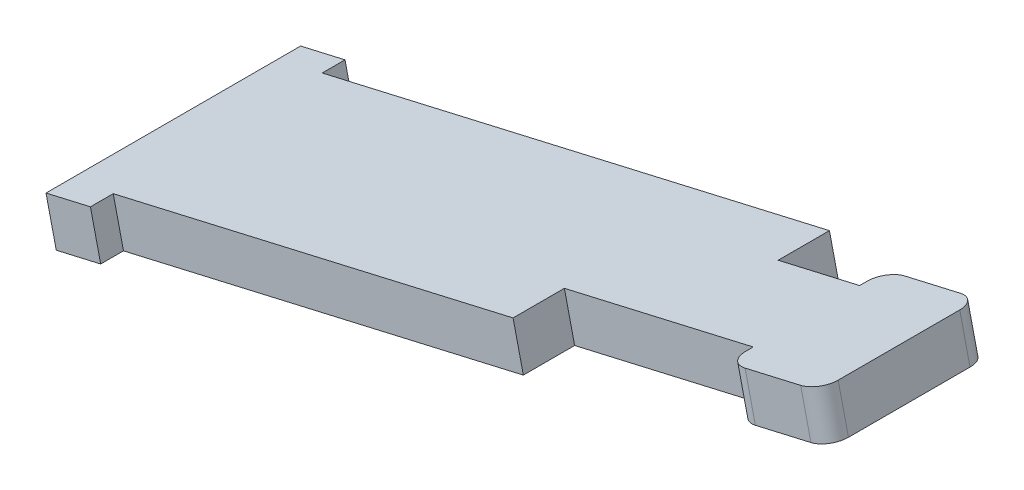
ISO-10303-21;
HEADER;
FILE_DESCRIPTION(('STEP AP214'),'2;1');
FILE_NAME('part.step','',(''),(''),'','','');
FILE_SCHEMA(('AUTOMOTIVE_DESIGN { 1 0 10303 214 1 1 1 1 }'));
ENDSEC;
DATA;
#1=APPLICATION_CONTEXT('core data for automotive mechanical design processes');
#2=APPLICATION_PROTOCOL_DEFINITION('international standard','automotive_design',2000,#1);
#3=PRODUCT_CONTEXT('',#1,'mechanical');
#4=PRODUCT('Part','Part','',(#3));
#5=PRODUCT_RELATED_PRODUCT_CATEGORY('part','',(#4));
#6=PRODUCT_DEFINITION_FORMATION('','',#4);
#7=PRODUCT_DEFINITION_CONTEXT('part definition',#1,'design');
#8=PRODUCT_DEFINITION('design','',#6,#7);
#9=PRODUCT_DEFINITION_SHAPE('','',#8);
#10=(LENGTH_UNIT() NAMED_UNIT(*) SI_UNIT(.MILLI.,.METRE.));
#11=(NAMED_UNIT(*) PLANE_ANGLE_UNIT() SI_UNIT($,.RADIAN.));
#12=(NAMED_UNIT(*) SI_UNIT($,.STERADIAN.) SOLID_ANGLE_UNIT());
#13=UNCERTAINTY_MEASURE_WITH_UNIT(LENGTH_MEASURE(1.E-05),#10,'distance_accuracy_value','');
#14=(GEOMETRIC_REPRESENTATION_CONTEXT(3) GLOBAL_UNCERTAINTY_ASSIGNED_CONTEXT((#13)) GLOBAL_UNIT_ASSIGNED_CONTEXT((#10,
#11,#12)) REPRESENTATION_CONTEXT('',''));
#15=CARTESIAN_POINT('',(0.,0.,0.));
#16=DIRECTION('',(0.,0.,1.));
#17=DIRECTION('',(1.,0.,0.));
#18=AXIS2_PLACEMENT_3D('',#15,#16,#17);
#19=CARTESIAN_POINT('',(-71.2352267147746,-19.5329859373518,27.5));
#20=DIRECTION('',(0.974370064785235,0.224951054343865,0.));
#21=DIRECTION('',(0.,0.,-1.));
#22=AXIS2_PLACEMENT_3D('',#19,#20,#21);
#23=PLANE('',#22);
#24=DIRECTION('',(0.,0.,1.));
#25=VECTOR('',#24,1.);
#26=CARTESIAN_POINT('',(-68.5358140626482,-31.2254267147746,27.5));
#27=LINE('',#26,#25);
#28=CARTESIAN_POINT('',(-68.5358140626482,-31.2254267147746,-33.5));
#29=VERTEX_POINT('',#28);
#30=CARTESIAN_POINT('',(-68.5358140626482,-31.2254267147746,33.5));
#31=VERTEX_POINT('',#30);
#32=EDGE_CURVE('E198',#29,#31,#27,.T.);
#33=ORIENTED_EDGE('',*,*,#32,.T.);
#34=DIRECTION('',(0.224951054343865,-0.974370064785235,0.));
#35=VECTOR('',#34,1.);
#36=CARTESIAN_POINT('',(-71.2352267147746,-19.5329859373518,33.5));
#37=LINE('',#36,#35);
#38=CARTESIAN_POINT('',(-71.2352267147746,-19.5329859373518,33.5));
#39=VERTEX_POINT('',#38);
#40=EDGE_CURVE('E197',#39,#31,#37,.T.);
#41=ORIENTED_EDGE('',*,*,#40,.F.);
#42=DIRECTION('',(0.,0.,1.));
#43=VECTOR('',#42,1.);
#44=CARTESIAN_POINT('',(-71.2352267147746,-19.5329859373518,-27.5));
#45=LINE('',#44,#43);
#46=CARTESIAN_POINT('',(-71.2352267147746,-19.5329859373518,-33.5));
#47=VERTEX_POINT('',#46);
#48=EDGE_CURVE('E182',#47,#39,#45,.T.);
#49=ORIENTED_EDGE('',*,*,#48,.F.);
#50=DIRECTION('',(0.224951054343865,-0.974370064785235,0.));
#51=VECTOR('',#50,1.);
#52=CARTESIAN_POINT('',(-71.2352267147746,-19.5329859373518,-33.5));
#53=LINE('',#52,#51);
#54=EDGE_CURVE('E239',#47,#29,#53,.T.);
#55=ORIENTED_EDGE('',*,*,#54,.T.);
#56=EDGE_LOOP('',(#33,#41,#49,#55));
#57=FACE_BOUND('',#56,.T.);
#58=ADVANCED_FACE('F45',(#57),#23,.F.);
#59=CARTESIAN_POINT('',(-71.2352267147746,-19.5329859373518,33.5));
#60=DIRECTION('',(0.,0.,-1.));
#61=DIRECTION('',(-0.974370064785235,-0.224951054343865,0.));
#62=AXIS2_PLACEMENT_3D('',#59,#60,#61);
#63=PLANE('',#62);
#64=DIRECTION('',(0.974370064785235,0.224951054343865,0.));
#65=VECTOR('',#64,1.);
#66=CARTESIAN_POINT('',(-68.5358140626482,-31.2254267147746,33.5));
#67=LINE('',#66,#65);
#68=CARTESIAN_POINT('',(-56.8433732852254,-28.5260140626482,33.5));
#69=VERTEX_POINT('',#68);
#70=EDGE_CURVE('E241',#31,#69,#67,.T.);
#71=ORIENTED_EDGE('',*,*,#70,.T.);
#72=DIRECTION('',(0.224951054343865,-0.974370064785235,0.));
#73=VECTOR('',#72,1.);
#74=CARTESIAN_POINT('',(-59.5427859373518,-16.8335732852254,33.5));
#75=LINE('',#74,#73);
#76=CARTESIAN_POINT('',(-59.5427859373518,-16.8335732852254,33.5));
#77=VERTEX_POINT('',#76);
#78=EDGE_CURVE('E202',#77,#69,#75,.T.);
#79=ORIENTED_EDGE('',*,*,#78,.F.);
#80=DIRECTION('',(0.974370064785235,0.224951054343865,0.));
#81=VECTOR('',#80,1.);
#82=CARTESIAN_POINT('',(-71.2352267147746,-19.5329859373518,33.5));
#83=LINE('',#82,#81);
#84=EDGE_CURVE('E187',#39,#77,#83,.T.);
#85=ORIENTED_EDGE('',*,*,#84,.F.);
#86=ORIENTED_EDGE('',*,*,#40,.T.);
#87=EDGE_LOOP('',(#71,#79,#85,#86));
#88=FACE_BOUND('',#87,.T.);
#89=ADVANCED_FACE('F204',(#88),#63,.F.);
#90=CARTESIAN_POINT('',(-59.5427859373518,-16.8335732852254,33.5));
#91=DIRECTION('',(-0.974370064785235,-0.224951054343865,0.));
#92=DIRECTION('',(0.,0.,1.));
#93=AXIS2_PLACEMENT_3D('',#90,#91,#92);
#94=PLANE('',#93);
#95=DIRECTION('',(0.,0.,-1.));
#96=VECTOR('',#95,1.);
#97=CARTESIAN_POINT('',(-56.8433732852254,-28.5260140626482,33.5));
#98=LINE('',#97,#96);
#99=CARTESIAN_POINT('',(-56.8433732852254,-28.5260140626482,27.5));
#100=VERTEX_POINT('',#99);
#101=EDGE_CURVE('E243',#69,#100,#98,.T.);
#102=ORIENTED_EDGE('',*,*,#101,.T.);
#103=DIRECTION('',(0.224951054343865,-0.974370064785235,0.));
#104=VECTOR('',#103,1.);
#105=CARTESIAN_POINT('',(-59.5427859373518,-16.8335732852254,27.5));
#106=LINE('',#105,#104);
#107=CARTESIAN_POINT('',(-59.5427859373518,-16.8335732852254,27.5));
#108=VERTEX_POINT('',#107);
#109=EDGE_CURVE('E300',#108,#100,#106,.T.);
#110=ORIENTED_EDGE('',*,*,#109,.F.);
#111=DIRECTION('',(0.,0.,-1.));
#112=VECTOR('',#111,1.);
#113=CARTESIAN_POINT('',(-59.5427859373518,-16.8335732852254,33.5));
#114=LINE('',#113,#112);
#115=EDGE_CURVE('E207',#77,#108,#114,.T.);
#116=ORIENTED_EDGE('',*,*,#115,.F.);
#117=ORIENTED_EDGE('',*,*,#78,.T.);
#118=EDGE_LOOP('',(#102,#110,#116,#117));
#119=FACE_BOUND('',#118,.T.);
#120=ADVANCED_FACE('F369',(#119),#94,.F.);
#121=CARTESIAN_POINT('',(-59.5427859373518,-16.8335732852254,27.5));
#122=DIRECTION('',(0.,0.,-1.));
#123=DIRECTION('',(-0.974370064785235,-0.224951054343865,0.));
#124=AXIS2_PLACEMENT_3D('',#121,#122,#123);
#125=PLANE('',#124);
#126=DIRECTION('',(0.974370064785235,0.224951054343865,0.));
#127=VECTOR('',#126,1.);
#128=CARTESIAN_POINT('',(-56.8433732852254,-28.5260140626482,27.5));
#129=LINE('',#128,#127);
#130=CARTESIAN_POINT('',(48.38859371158,-4.2313001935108,27.5));
#131=VERTEX_POINT('',#130);
#132=EDGE_CURVE('E245',#100,#131,#129,.T.);
#133=ORIENTED_EDGE('',*,*,#132,.T.);
#134=DIRECTION('',(0.224951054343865,-0.974370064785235,0.));
#135=VECTOR('',#134,1.);
#136=CARTESIAN_POINT('',(45.6891810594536,7.46114058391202,27.5));
#137=LINE('',#136,#135);
#138=CARTESIAN_POINT('',(45.6891810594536,7.46114058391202,27.5));
#139=VERTEX_POINT('',#138);
#140=EDGE_CURVE('E297',#139,#131,#137,.T.);
#141=ORIENTED_EDGE('',*,*,#140,.F.);
#142=DIRECTION('',(0.974370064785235,0.224951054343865,0.));
#143=VECTOR('',#142,1.);
#144=CARTESIAN_POINT('',(-59.5427859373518,-16.8335732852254,27.5));
#145=LINE('',#144,#143);
#146=EDGE_CURVE('E209',#108,#139,#145,.T.);
#147=ORIENTED_EDGE('',*,*,#146,.F.);
#148=ORIENTED_EDGE('',*,*,#109,.T.);
#149=EDGE_LOOP('',(#133,#141,#147,#148));
#150=FACE_BOUND('',#149,.T.);
#151=ADVANCED_FACE('F376',(#150),#125,.F.);
#152=CARTESIAN_POINT('',(45.6891810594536,7.46114058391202,14.));
#153=DIRECTION('',(-0.974370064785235,-0.224951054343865,0.));
#154=DIRECTION('',(0.,0.,1.));
#155=AXIS2_PLACEMENT_3D('',#152,#153,#154);
#156=PLANE('',#155);
#157=DIRECTION('',(0.,0.,-1.));
#158=VECTOR('',#157,1.);
#159=CARTESIAN_POINT('',(48.38859371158,-4.2313001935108,14.));
#160=LINE('',#159,#158);
#161=CARTESIAN_POINT('',(48.38859371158,-4.2313001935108,14.));
#162=VERTEX_POINT('',#161);
#163=EDGE_CURVE('E247',#131,#162,#160,.T.);
#164=ORIENTED_EDGE('',*,*,#163,.T.);
#165=DIRECTION('',(0.224951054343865,-0.974370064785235,0.));
#166=VECTOR('',#165,1.);
#167=CARTESIAN_POINT('',(45.6891810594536,7.46114058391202,14.));
#168=LINE('',#167,#166);
#169=CARTESIAN_POINT('',(45.6891810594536,7.46114058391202,14.));
#170=VERTEX_POINT('',#169);
#171=EDGE_CURVE('E294',#170,#162,#168,.T.);
#172=ORIENTED_EDGE('',*,*,#171,.F.);
#173=DIRECTION('',(0.,0.,-1.));
#174=VECTOR('',#173,1.);
#175=CARTESIAN_POINT('',(45.6891810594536,7.46114058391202,14.));
#176=LINE('',#175,#174);
#177=EDGE_CURVE('E214',#139,#170,#176,.T.);
#178=ORIENTED_EDGE('',*,*,#177,.F.);
#179=ORIENTED_EDGE('',*,*,#140,.T.);
#180=EDGE_LOOP('',(#164,#172,#178,#179));
#181=FACE_BOUND('',#180,.T.);
#182=ADVANCED_FACE('F379',(#181),#156,.F.);
#183=CARTESIAN_POINT('',(73.9459129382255,13.9847211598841,14.));
#184=DIRECTION('',(0.,0.,-1.));
#185=DIRECTION('',(-0.974370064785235,-0.224951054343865,0.));
#186=AXIS2_PLACEMENT_3D('',#183,#184,#185);
#187=PLANE('',#186);
#188=DIRECTION('',(0.974370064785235,0.224951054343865,0.));
#189=VECTOR('',#188,1.);
#190=CARTESIAN_POINT('',(76.6453255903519,2.29228038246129,14.));
#191=LINE('',#190,#189);
#192=CARTESIAN_POINT('',(98.081467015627,7.24120357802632,14.));
#193=VERTEX_POINT('',#192);
#194=EDGE_CURVE('E250',#162,#193,#191,.T.);
#195=ORIENTED_EDGE('',*,*,#194,.T.);
#196=DIRECTION('',(0.224951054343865,-0.974370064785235,0.));
#197=VECTOR('',#196,1.);
#198=CARTESIAN_POINT('',(95.3820543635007,18.9336443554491,14.));
#199=LINE('',#198,#197);
#200=CARTESIAN_POINT('',(95.3820543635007,18.9336443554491,14.));
#201=VERTEX_POINT('',#200);
#202=EDGE_CURVE('E291',#201,#193,#199,.T.);
#203=ORIENTED_EDGE('',*,*,#202,.F.);
#204=DIRECTION('',(0.974370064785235,0.224951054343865,0.));
#205=VECTOR('',#204,1.);
#206=CARTESIAN_POINT('',(73.9459129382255,13.9847211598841,14.));
#207=LINE('',#206,#205);
#208=EDGE_CURVE('E216',#170,#201,#207,.T.);
#209=ORIENTED_EDGE('',*,*,#208,.F.);
#210=ORIENTED_EDGE('',*,*,#171,.T.);
#211=EDGE_LOOP('',(#195,#203,#209,#210));
#212=FACE_BOUND('',#211,.T.);
#213=ADVANCED_FACE('F383',(#212),#187,.F.);
#214=CARTESIAN_POINT('',(95.3820543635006,18.9336443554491,21.));
#215=DIRECTION('',(0.974370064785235,0.224951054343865,0.));
#216=DIRECTION('',(0.,0.,-1.));
#217=AXIS2_PLACEMENT_3D('',#214,#215,#216);
#218=PLANE('',#217);
#219=DIRECTION('',(0.,0.,1.));
#220=VECTOR('',#219,1.);
#221=CARTESIAN_POINT('',(98.081467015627,7.24120357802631,21.));
#222=LINE('',#221,#220);
#223=CARTESIAN_POINT('',(98.081467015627,7.24120357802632,16.));
#224=VERTEX_POINT('',#223);
#225=EDGE_CURVE('E252',#193,#224,#222,.T.);
#226=ORIENTED_EDGE('',*,*,#225,.T.);
#227=DIRECTION('',(0.224951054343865,-0.974370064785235,0.));
#228=VECTOR('',#227,1.);
#229=CARTESIAN_POINT('',(95.3820543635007,18.9336443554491,16.));
#230=LINE('',#229,#228);
#231=CARTESIAN_POINT('',(95.3820543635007,18.9336443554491,16.));
#232=VERTEX_POINT('',#231);
#233=EDGE_CURVE('E12',#224,#232,#230,.F.);
#234=ORIENTED_EDGE('',*,*,#233,.T.);
#235=DIRECTION('',(0.,0.,1.));
#236=VECTOR('',#235,1.);
#237=CARTESIAN_POINT('',(95.3820543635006,18.9336443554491,21.));
#238=LINE('',#237,#236);
#239=EDGE_CURVE('E218',#201,#232,#238,.T.);
#240=ORIENTED_EDGE('',*,*,#239,.F.);
#241=ORIENTED_EDGE('',*,*,#202,.T.);
#242=EDGE_LOOP('',(#226,#234,#240,#241));
#243=FACE_BOUND('',#242,.T.);
#244=ADVANCED_FACE('F460',(#243),#218,.F.);
#245=CARTESIAN_POINT('',(119.741305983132,24.5574207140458,21.));
#246=DIRECTION('',(0.,0.,-1.));
#247=DIRECTION('',(-0.974370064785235,-0.224951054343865,0.));
#248=AXIS2_PLACEMENT_3D('',#245,#246,#247);
#249=PLANE('',#248);
#250=DIRECTION('',(0.974370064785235,0.224951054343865,0.));
#251=VECTOR('',#250,1.);
#252=CARTESIAN_POINT('',(122.440718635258,12.8649799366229,21.));
#253=LINE('',#252,#251);
#254=CARTESIAN_POINT('',(102.953317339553,8.36595884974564,21.));
#255=VERTEX_POINT('',#254);
#256=CARTESIAN_POINT('',(117.568868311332,11.7402246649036,21.));
#257=VERTEX_POINT('',#256);
#258=EDGE_CURVE('E255',#255,#257,#253,.T.);
#259=ORIENTED_EDGE('',*,*,#258,.T.);
#260=DIRECTION('',(0.224951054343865,-0.974370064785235,0.));
#261=VECTOR('',#260,1.);
#262=CARTESIAN_POINT('',(114.869455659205,23.4326654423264,21.));
#263=LINE('',#262,#261);
#264=CARTESIAN_POINT('',(114.869455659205,23.4326654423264,21.));
#265=VERTEX_POINT('',#264);
#266=EDGE_CURVE('E319',#257,#265,#263,.F.);
#267=ORIENTED_EDGE('',*,*,#266,.T.);
#268=DIRECTION('',(0.974370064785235,0.224951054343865,0.));
#269=VECTOR('',#268,1.);
#270=CARTESIAN_POINT('',(119.741305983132,24.5574207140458,21.));
#271=LINE('',#270,#269);
#272=CARTESIAN_POINT('',(100.253904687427,20.0583996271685,21.));
#273=VERTEX_POINT('',#272);
#274=EDGE_CURVE('E221',#273,#265,#271,.T.);
#275=ORIENTED_EDGE('',*,*,#274,.F.);
#276=DIRECTION('',(0.224951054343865,-0.974370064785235,0.));
#277=VECTOR('',#276,1.);
#278=CARTESIAN_POINT('',(100.253904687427,20.0583996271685,21.));
#279=LINE('',#278,#277);
#280=EDGE_CURVE('E316',#273,#255,#279,.T.);
#281=ORIENTED_EDGE('',*,*,#280,.T.);
#282=EDGE_LOOP('',(#259,#267,#275,#281));
#283=FACE_BOUND('',#282,.T.);
#284=ADVANCED_FACE('F393',(#283),#249,.F.);
#285=CARTESIAN_POINT('',(119.741305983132,24.5574207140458,-21.));
#286=DIRECTION('',(-0.974370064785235,-0.224951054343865,0.));
#287=DIRECTION('',(0.,0.,1.));
#288=AXIS2_PLACEMENT_3D('',#285,#286,#287);
#289=PLANE('',#288);
#290=DIRECTION('',(0.,0.,-1.));
#291=VECTOR('',#290,1.);
#292=CARTESIAN_POINT('',(119.741305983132,24.5574207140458,-21.));
#293=LINE('',#292,#291);
#294=CARTESIAN_POINT('',(119.741305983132,24.5574207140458,16.));
#295=VERTEX_POINT('',#294);
#296=CARTESIAN_POINT('',(119.741305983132,24.5574207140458,-16.));
#297=VERTEX_POINT('',#296);
#298=EDGE_CURVE('E223',#295,#297,#293,.T.);
#299=ORIENTED_EDGE('',*,*,#298,.F.);
#300=DIRECTION('',(0.224951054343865,-0.974370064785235,0.));
#301=VECTOR('',#300,1.);
#302=CARTESIAN_POINT('',(119.741305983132,24.5574207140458,16.));
#303=LINE('',#302,#301);
#304=CARTESIAN_POINT('',(122.440718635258,12.8649799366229,16.));
#305=VERTEX_POINT('',#304);
#306=EDGE_CURVE('E305',#295,#305,#303,.T.);
#307=ORIENTED_EDGE('',*,*,#306,.T.);
#308=DIRECTION('',(0.,0.,-1.));
#309=VECTOR('',#308,1.);
#310=CARTESIAN_POINT('',(122.440718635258,12.8649799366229,-21.));
#311=LINE('',#310,#309);
#312=CARTESIAN_POINT('',(122.440718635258,12.8649799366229,-16.));
#313=VERTEX_POINT('',#312);
#314=EDGE_CURVE('E258',#305,#313,#311,.T.);
#315=ORIENTED_EDGE('',*,*,#314,.T.);
#316=DIRECTION('',(0.224951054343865,-0.974370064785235,0.));
#317=VECTOR('',#316,1.);
#318=CARTESIAN_POINT('',(119.741305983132,24.5574207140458,-16.));
#319=LINE('',#318,#317);
#320=EDGE_CURVE('E201',#313,#297,#319,.F.);
#321=ORIENTED_EDGE('',*,*,#320,.T.);
#322=EDGE_LOOP('',(#299,#307,#315,#321));
#323=FACE_BOUND('',#322,.T.);
#324=ADVANCED_FACE('F402',(#323),#289,.F.);
#325=CARTESIAN_POINT('',(119.741305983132,24.5574207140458,-21.));
#326=DIRECTION('',(0.,0.,1.));
#327=DIRECTION('',(0.974370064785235,0.224951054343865,0.));
#328=AXIS2_PLACEMENT_3D('',#325,#326,#327);
#329=PLANE('',#328);
#330=DIRECTION('',(-0.974370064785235,-0.224951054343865,0.));
#331=VECTOR('',#330,1.);
#332=CARTESIAN_POINT('',(119.741305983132,24.5574207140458,-21.));
#333=LINE('',#332,#331);
#334=CARTESIAN_POINT('',(114.869455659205,23.4326654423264,-21.));
#335=VERTEX_POINT('',#334);
#336=CARTESIAN_POINT('',(100.253904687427,20.0583996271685,-21.));
#337=VERTEX_POINT('',#336);
#338=EDGE_CURVE('E226',#335,#337,#333,.T.);
#339=ORIENTED_EDGE('',*,*,#338,.F.);
#340=DIRECTION('',(0.224951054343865,-0.974370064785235,0.));
#341=VECTOR('',#340,1.);
#342=CARTESIAN_POINT('',(114.869455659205,23.4326654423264,-21.));
#343=LINE('',#342,#341);
#344=CARTESIAN_POINT('',(117.568868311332,11.7402246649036,-21.));
#345=VERTEX_POINT('',#344);
#346=EDGE_CURVE('E329',#335,#345,#343,.T.);
#347=ORIENTED_EDGE('',*,*,#346,.T.);
#348=DIRECTION('',(-0.974370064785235,-0.224951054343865,0.));
#349=VECTOR('',#348,1.);
#350=CARTESIAN_POINT('',(122.440718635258,12.8649799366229,-21.));
#351=LINE('',#350,#349);
#352=CARTESIAN_POINT('',(102.953317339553,8.36595884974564,-21.));
#353=VERTEX_POINT('',#352);
#354=EDGE_CURVE('E261',#345,#353,#351,.T.);
#355=ORIENTED_EDGE('',*,*,#354,.T.);
#356=DIRECTION('',(0.224951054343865,-0.974370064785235,0.));
#357=VECTOR('',#356,1.);
#358=CARTESIAN_POINT('',(100.253904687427,20.0583996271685,-21.));
#359=LINE('',#358,#357);
#360=EDGE_CURVE('E69',#353,#337,#359,.F.);
#361=ORIENTED_EDGE('',*,*,#360,.T.);
#362=EDGE_LOOP('',(#339,#347,#355,#361));
#363=FACE_BOUND('',#362,.T.);
#364=ADVANCED_FACE('F408',(#363),#329,.F.);
#365=CARTESIAN_POINT('',(95.3820543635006,18.9336443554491,-21.));
#366=DIRECTION('',(0.974370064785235,0.224951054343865,0.));
#367=DIRECTION('',(0.,0.,-1.));
#368=AXIS2_PLACEMENT_3D('',#365,#366,#367);
#369=PLANE('',#368);
#370=DIRECTION('',(0.,0.,1.));
#371=VECTOR('',#370,1.);
#372=CARTESIAN_POINT('',(95.3820543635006,18.9336443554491,-21.));
#373=LINE('',#372,#371);
#374=CARTESIAN_POINT('',(95.3820543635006,18.9336443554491,-16.));
#375=VERTEX_POINT('',#374);
#376=CARTESIAN_POINT('',(95.3820543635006,18.9336443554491,-14.));
#377=VERTEX_POINT('',#376);
#378=EDGE_CURVE('E228',#375,#377,#373,.T.);
#379=ORIENTED_EDGE('',*,*,#378,.F.);
#380=DIRECTION('',(0.224951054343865,-0.974370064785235,0.));
#381=VECTOR('',#380,1.);
#382=CARTESIAN_POINT('',(95.3820543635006,18.9336443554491,-16.));
#383=LINE('',#382,#381);
#384=CARTESIAN_POINT('',(98.081467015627,7.24120357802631,-16.));
#385=VERTEX_POINT('',#384);
#386=EDGE_CURVE('E54',#375,#385,#383,.T.);
#387=ORIENTED_EDGE('',*,*,#386,.T.);
#388=DIRECTION('',(0.,0.,1.));
#389=VECTOR('',#388,1.);
#390=CARTESIAN_POINT('',(98.081467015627,7.24120357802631,-21.));
#391=LINE('',#390,#389);
#392=CARTESIAN_POINT('',(98.081467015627,7.24120357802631,-14.));
#393=VERTEX_POINT('',#392);
#394=EDGE_CURVE('E263',#385,#393,#391,.T.);
#395=ORIENTED_EDGE('',*,*,#394,.T.);
#396=DIRECTION('',(0.224951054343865,-0.974370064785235,0.));
#397=VECTOR('',#396,1.);
#398=CARTESIAN_POINT('',(95.3820543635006,18.9336443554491,-14.));
#399=LINE('',#398,#397);
#400=EDGE_CURVE('E288',#377,#393,#399,.T.);
#401=ORIENTED_EDGE('',*,*,#400,.F.);
#402=EDGE_LOOP('',(#379,#387,#395,#401));
#403=FACE_BOUND('',#402,.T.);
#404=ADVANCED_FACE('F336',(#403),#369,.F.);
#405=CARTESIAN_POINT('',(73.9459129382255,13.9847211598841,-14.));
#406=DIRECTION('',(0.,0.,1.));
#407=DIRECTION('',(0.974370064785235,0.224951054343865,0.));
#408=AXIS2_PLACEMENT_3D('',#405,#406,#407);
#409=PLANE('',#408);
#410=DIRECTION('',(-0.974370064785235,-0.224951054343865,0.));
#411=VECTOR('',#410,1.);
#412=CARTESIAN_POINT('',(76.6453255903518,2.29228038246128,-14.));
#413=LINE('',#412,#411);
#414=CARTESIAN_POINT('',(76.6453255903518,2.29228038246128,-14.));
#415=VERTEX_POINT('',#414);
#416=EDGE_CURVE('E265',#393,#415,#413,.T.);
#417=ORIENTED_EDGE('',*,*,#416,.T.);
#418=DIRECTION('',(0.224951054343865,-0.974370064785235,0.));
#419=VECTOR('',#418,1.);
#420=CARTESIAN_POINT('',(73.9459129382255,13.9847211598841,-14.));
#421=LINE('',#420,#419);
#422=CARTESIAN_POINT('',(73.9459129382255,13.9847211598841,-14.));
#423=VERTEX_POINT('',#422);
#424=EDGE_CURVE('E285',#423,#415,#421,.T.);
#425=ORIENTED_EDGE('',*,*,#424,.F.);
#426=DIRECTION('',(-0.974370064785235,-0.224951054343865,0.));
#427=VECTOR('',#426,1.);
#428=CARTESIAN_POINT('',(73.9459129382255,13.9847211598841,-14.));
#429=LINE('',#428,#427);
#430=EDGE_CURVE('E230',#377,#423,#429,.T.);
#431=ORIENTED_EDGE('',*,*,#430,.F.);
#432=ORIENTED_EDGE('',*,*,#400,.T.);
#433=EDGE_LOOP('',(#417,#425,#431,#432));
#434=FACE_BOUND('',#433,.T.);
#435=ADVANCED_FACE('F348',(#434),#409,.F.);
#436=CARTESIAN_POINT('',(73.9459129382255,13.9847211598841,-27.5));
#437=DIRECTION('',(-0.974370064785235,-0.224951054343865,0.));
#438=DIRECTION('',(0.,0.,1.));
#439=AXIS2_PLACEMENT_3D('',#436,#437,#438);
#440=PLANE('',#439);
#441=DIRECTION('',(0.,0.,-1.));
#442=VECTOR('',#441,1.);
#443=CARTESIAN_POINT('',(76.6453255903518,2.29228038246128,-27.5));
#444=LINE('',#443,#442);
#445=CARTESIAN_POINT('',(76.6453255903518,2.29228038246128,-27.5));
#446=VERTEX_POINT('',#445);
#447=EDGE_CURVE('E267',#415,#446,#444,.T.);
#448=ORIENTED_EDGE('',*,*,#447,.T.);
#449=DIRECTION('',(0.224951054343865,-0.974370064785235,0.));
#450=VECTOR('',#449,1.);
#451=CARTESIAN_POINT('',(73.9459129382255,13.9847211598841,-27.5));
#452=LINE('',#451,#450);
#453=CARTESIAN_POINT('',(73.9459129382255,13.9847211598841,-27.5));
#454=VERTEX_POINT('',#453);
#455=EDGE_CURVE('E282',#454,#446,#452,.T.);
#456=ORIENTED_EDGE('',*,*,#455,.F.);
#457=DIRECTION('',(0.,0.,-1.));
#458=VECTOR('',#457,1.);
#459=CARTESIAN_POINT('',(73.9459129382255,13.9847211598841,-27.5));
#460=LINE('',#459,#458);
#461=EDGE_CURVE('E232',#423,#454,#460,.T.);
#462=ORIENTED_EDGE('',*,*,#461,.F.);
#463=ORIENTED_EDGE('',*,*,#424,.T.);
#464=EDGE_LOOP('',(#448,#456,#462,#463));
#465=FACE_BOUND('',#464,.T.);
#466=ADVANCED_FACE('F352',(#465),#440,.F.);
#467=CARTESIAN_POINT('',(-59.5427859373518,-16.8335732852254,-27.5));
#468=DIRECTION('',(0.,0.,1.));
#469=DIRECTION('',(0.974370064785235,0.224951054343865,0.));
#470=AXIS2_PLACEMENT_3D('',#467,#468,#469);
#471=PLANE('',#470);
#472=DIRECTION('',(-0.974370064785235,-0.224951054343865,0.));
#473=VECTOR('',#472,1.);
#474=CARTESIAN_POINT('',(-56.8433732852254,-28.5260140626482,-27.5));
#475=LINE('',#474,#473);
#476=CARTESIAN_POINT('',(-56.8433732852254,-28.5260140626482,-27.5));
#477=VERTEX_POINT('',#476);
#478=EDGE_CURVE('E269',#446,#477,#475,.T.);
#479=ORIENTED_EDGE('',*,*,#478,.T.);
#480=DIRECTION('',(0.224951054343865,-0.974370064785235,0.));
#481=VECTOR('',#480,1.);
#482=CARTESIAN_POINT('',(-59.5427859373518,-16.8335732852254,-27.5));
#483=LINE('',#482,#481);
#484=CARTESIAN_POINT('',(-59.5427859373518,-16.8335732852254,-27.5));
#485=VERTEX_POINT('',#484);
#486=EDGE_CURVE('E279',#485,#477,#483,.T.);
#487=ORIENTED_EDGE('',*,*,#486,.F.);
#488=DIRECTION('',(-0.974370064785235,-0.224951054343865,0.));
#489=VECTOR('',#488,1.);
#490=CARTESIAN_POINT('',(-59.5427859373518,-16.8335732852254,-27.5));
#491=LINE('',#490,#489);
#492=EDGE_CURVE('E234',#454,#485,#491,.T.);
#493=ORIENTED_EDGE('',*,*,#492,.F.);
#494=ORIENTED_EDGE('',*,*,#455,.T.);
#495=EDGE_LOOP('',(#479,#487,#493,#494));
#496=FACE_BOUND('',#495,.T.);
#497=ADVANCED_FACE('F359',(#496),#471,.F.);
#498=CARTESIAN_POINT('',(-59.5427859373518,-16.8335732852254,-33.5));
#499=DIRECTION('',(-0.974370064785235,-0.224951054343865,0.));
#500=DIRECTION('',(0.,0.,1.));
#501=AXIS2_PLACEMENT_3D('',#498,#499,#500);
#502=PLANE('',#501);
#503=DIRECTION('',(0.,0.,-1.));
#504=VECTOR('',#503,1.);
#505=CARTESIAN_POINT('',(-56.8433732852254,-28.5260140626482,-33.5));
#506=LINE('',#505,#504);
#507=CARTESIAN_POINT('',(-56.8433732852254,-28.5260140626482,-33.5));
#508=VERTEX_POINT('',#507);
#509=EDGE_CURVE('E271',#477,#508,#506,.T.);
#510=ORIENTED_EDGE('',*,*,#509,.T.);
#511=DIRECTION('',(0.224951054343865,-0.974370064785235,0.));
#512=VECTOR('',#511,1.);
#513=CARTESIAN_POINT('',(-59.5427859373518,-16.8335732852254,-33.5));
#514=LINE('',#513,#512);
#515=CARTESIAN_POINT('',(-59.5427859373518,-16.8335732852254,-33.5));
#516=VERTEX_POINT('',#515);
#517=EDGE_CURVE('E276',#516,#508,#514,.T.);
#518=ORIENTED_EDGE('',*,*,#517,.F.);
#519=DIRECTION('',(0.,0.,-1.));
#520=VECTOR('',#519,1.);
#521=CARTESIAN_POINT('',(-59.5427859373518,-16.8335732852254,-33.5));
#522=LINE('',#521,#520);
#523=EDGE_CURVE('E236',#485,#516,#522,.T.);
#524=ORIENTED_EDGE('',*,*,#523,.F.);
#525=ORIENTED_EDGE('',*,*,#486,.T.);
#526=EDGE_LOOP('',(#510,#518,#524,#525));
#527=FACE_BOUND('',#526,.T.);
#528=ADVANCED_FACE('F362',(#527),#502,.F.);
#529=CARTESIAN_POINT('',(-71.2352267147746,-19.5329859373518,-33.5));
#530=DIRECTION('',(0.,0.,1.));
#531=DIRECTION('',(0.974370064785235,0.224951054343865,0.));
#532=AXIS2_PLACEMENT_3D('',#529,#530,#531);
#533=PLANE('',#532);
#534=DIRECTION('',(-0.974370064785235,-0.224951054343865,0.));
#535=VECTOR('',#534,1.);
#536=CARTESIAN_POINT('',(-68.5358140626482,-31.2254267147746,-33.5));
#537=LINE('',#536,#535);
#538=EDGE_CURVE('E194',#508,#29,#537,.T.);
#539=ORIENTED_EDGE('',*,*,#538,.T.);
#540=ORIENTED_EDGE('',*,*,#54,.F.);
#541=DIRECTION('',(-0.974370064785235,-0.224951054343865,0.));
#542=VECTOR('',#541,1.);
#543=CARTESIAN_POINT('',(-71.2352267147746,-19.5329859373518,-33.5));
#544=LINE('',#543,#542);
#545=EDGE_CURVE('E190',#516,#47,#544,.T.);
#546=ORIENTED_EDGE('',*,*,#545,.F.);
#547=ORIENTED_EDGE('',*,*,#517,.T.);
#548=EDGE_LOOP('',(#539,#540,#546,#547));
#549=FACE_BOUND('',#548,.T.);
#550=ADVANCED_FACE('F365',(#549),#533,.F.);
#551=CARTESIAN_POINT('',(-2.99102943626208,-3.77757155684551,0.));
#552=DIRECTION('',(0.224951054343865,-0.974370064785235,0.));
#553=DIRECTION('',(0.,0.,-1.));
#554=AXIS2_PLACEMENT_3D('',#551,#552,#553);
#555=PLANE('',#554);
#556=ORIENTED_EDGE('',*,*,#274,.T.);
#557=CARTESIAN_POINT('',(114.869455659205,23.4326654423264,16.));
#558=DIRECTION('',(0.224951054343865,-0.974370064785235,0.));
#559=DIRECTION('',(0.,0.,-1.));
#560=AXIS2_PLACEMENT_3D('',#557,#558,#559);
#561=CIRCLE('',#560,5.);
#562=EDGE_CURVE('E326',#265,#295,#561,.F.);
#563=ORIENTED_EDGE('',*,*,#562,.T.);
#564=ORIENTED_EDGE('',*,*,#298,.T.);
#565=CARTESIAN_POINT('',(114.869455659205,23.4326654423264,-16.));
#566=DIRECTION('',(0.224951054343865,-0.974370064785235,0.));
#567=DIRECTION('',(0.,0.,-1.));
#568=AXIS2_PLACEMENT_3D('',#565,#566,#567);
#569=CIRCLE('',#568,5.);
#570=EDGE_CURVE('E324',#297,#335,#569,.F.);
#571=ORIENTED_EDGE('',*,*,#570,.T.);
#572=ORIENTED_EDGE('',*,*,#338,.T.);
#573=CARTESIAN_POINT('',(100.253904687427,20.0583996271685,-16.));
#574=DIRECTION('',(0.224951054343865,-0.974370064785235,0.));
#575=DIRECTION('',(0.,0.,-1.));
#576=AXIS2_PLACEMENT_3D('',#573,#574,#575);
#577=CIRCLE('',#576,5.);
#578=EDGE_CURVE('E61',#337,#375,#577,.F.);
#579=ORIENTED_EDGE('',*,*,#578,.T.);
#580=ORIENTED_EDGE('',*,*,#378,.T.);
#581=ORIENTED_EDGE('',*,*,#430,.T.);
#582=ORIENTED_EDGE('',*,*,#461,.T.);
#583=ORIENTED_EDGE('',*,*,#492,.T.);
#584=ORIENTED_EDGE('',*,*,#523,.T.);
#585=ORIENTED_EDGE('',*,*,#545,.T.);
#586=ORIENTED_EDGE('',*,*,#48,.T.);
#587=ORIENTED_EDGE('',*,*,#84,.T.);
#588=ORIENTED_EDGE('',*,*,#115,.T.);
#589=ORIENTED_EDGE('',*,*,#146,.T.);
#590=ORIENTED_EDGE('',*,*,#177,.T.);
#591=ORIENTED_EDGE('',*,*,#208,.T.);
#592=ORIENTED_EDGE('',*,*,#239,.T.);
#593=CARTESIAN_POINT('',(100.253904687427,20.0583996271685,16.));
#594=DIRECTION('',(0.224951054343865,-0.974370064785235,0.));
#595=DIRECTION('',(0.,0.,-1.));
#596=AXIS2_PLACEMENT_3D('',#593,#594,#595);
#597=CIRCLE('',#596,5.);
#598=EDGE_CURVE('E321',#232,#273,#597,.F.);
#599=ORIENTED_EDGE('',*,*,#598,.T.);
#600=EDGE_LOOP('',(#556,#563,#564,#571,#572,#579,#580,#581,#582,#583,#584,#585,#586,#587,#588,
#589,#590,#591,#592,#599));
#601=FACE_BOUND('',#600,.T.);
#602=ADVANCED_FACE('F185',(#601),#555,.F.);
#603=CARTESIAN_POINT('',(-0.291616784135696,-15.4700123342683,0.));
#604=DIRECTION('',(0.224951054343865,-0.974370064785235,0.));
#605=DIRECTION('',(0.,0.,-1.));
#606=AXIS2_PLACEMENT_3D('',#603,#604,#605);
#607=PLANE('',#606);
#608=CARTESIAN_POINT('',(38.9607,-6.40790096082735,0.));
#609=DIRECTION('',(0.224951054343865,-0.974370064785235,0.));
#610=DIRECTION('',(-0.974370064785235,-0.224951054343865,0.));
#611=AXIS2_PLACEMENT_3D('',#608,#609,#610);
#612=ELLIPSE('',#611,12.8288013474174,12.5);
#613=CARTESIAN_POINT('',(26.4607,-9.29375334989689,0.));
#614=VERTEX_POINT('',#613);
#615=EDGE_CURVE('E49',#614,#614,#612,.F.);
#616=ORIENTED_EDGE('',*,*,#615,.T.);
#617=EDGE_LOOP('',(#616));
#618=FACE_BOUND('',#617,.T.);
#619=ORIENTED_EDGE('',*,*,#314,.F.);
#620=CARTESIAN_POINT('',(117.568868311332,11.7402246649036,16.));
#621=DIRECTION('',(0.224951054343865,-0.974370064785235,0.));
#622=DIRECTION('',(0.,0.,-1.));
#623=AXIS2_PLACEMENT_3D('',#620,#621,#622);
#624=CIRCLE('',#623,5.);
#625=EDGE_CURVE('E314',#305,#257,#624,.T.);
#626=ORIENTED_EDGE('',*,*,#625,.T.);
#627=ORIENTED_EDGE('',*,*,#258,.F.);
#628=CARTESIAN_POINT('',(102.953317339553,8.36595884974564,16.));
#629=DIRECTION('',(0.224951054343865,-0.974370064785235,0.));
#630=DIRECTION('',(0.,0.,-1.));
#631=AXIS2_PLACEMENT_3D('',#628,#629,#630);
#632=CIRCLE('',#631,5.);
#633=EDGE_CURVE('E308',#255,#224,#632,.T.);
#634=ORIENTED_EDGE('',*,*,#633,.T.);
#635=ORIENTED_EDGE('',*,*,#225,.F.);
#636=ORIENTED_EDGE('',*,*,#194,.F.);
#637=ORIENTED_EDGE('',*,*,#163,.F.);
#638=ORIENTED_EDGE('',*,*,#132,.F.);
#639=ORIENTED_EDGE('',*,*,#101,.F.);
#640=ORIENTED_EDGE('',*,*,#70,.F.);
#641=ORIENTED_EDGE('',*,*,#32,.F.);
#642=ORIENTED_EDGE('',*,*,#538,.F.);
#643=ORIENTED_EDGE('',*,*,#509,.F.);
#644=ORIENTED_EDGE('',*,*,#478,.F.);
#645=ORIENTED_EDGE('',*,*,#447,.F.);
#646=ORIENTED_EDGE('',*,*,#416,.F.);
#647=ORIENTED_EDGE('',*,*,#394,.F.);
#648=CARTESIAN_POINT('',(102.953317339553,8.36595884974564,-16.));
#649=DIRECTION('',(0.224951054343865,-0.974370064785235,0.));
#650=DIRECTION('',(0.,0.,-1.));
#651=AXIS2_PLACEMENT_3D('',#648,#649,#650);
#652=CIRCLE('',#651,5.);
#653=EDGE_CURVE('E310',#385,#353,#652,.T.);
#654=ORIENTED_EDGE('',*,*,#653,.T.);
#655=ORIENTED_EDGE('',*,*,#354,.F.);
#656=CARTESIAN_POINT('',(117.568868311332,11.7402246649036,-16.));
#657=DIRECTION('',(0.224951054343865,-0.974370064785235,0.));
#658=DIRECTION('',(0.,0.,-1.));
#659=AXIS2_PLACEMENT_3D('',#656,#657,#658);
#660=CIRCLE('',#659,5.);
#661=EDGE_CURVE('E312',#345,#313,#660,.T.);
#662=ORIENTED_EDGE('',*,*,#661,.T.);
#663=EDGE_LOOP('',(#619,#626,#627,#634,#635,#636,#637,#638,#639,#640,#641,#642,#643,#644,#645,
#646,#647,#654,#655,#662));
#664=FACE_BOUND('',#663,.T.);
#665=ADVANCED_FACE('F342',(#618,#664),#607,.T.);
#666=CARTESIAN_POINT('',(114.869455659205,23.4326654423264,16.));
#667=DIRECTION('',(0.224951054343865,-0.974370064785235,0.));
#668=DIRECTION('',(0.,0.,-1.));
#669=AXIS2_PLACEMENT_3D('',#666,#667,#668);
#670=CYLINDRICAL_SURFACE('',#669,5.);
#671=ORIENTED_EDGE('',*,*,#562,.F.);
#672=ORIENTED_EDGE('',*,*,#266,.F.);
#673=ORIENTED_EDGE('',*,*,#625,.F.);
#674=ORIENTED_EDGE('',*,*,#306,.F.);
#675=EDGE_LOOP('',(#671,#672,#673,#674));
#676=FACE_BOUND('',#675,.T.);
#677=ADVANCED_FACE('F399',(#676),#670,.T.);
#678=CARTESIAN_POINT('',(114.869455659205,23.4326654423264,-16.));
#679=DIRECTION('',(0.224951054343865,-0.974370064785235,0.));
#680=DIRECTION('',(0.,0.,-1.));
#681=AXIS2_PLACEMENT_3D('',#678,#679,#680);
#682=CYLINDRICAL_SURFACE('',#681,5.);
#683=ORIENTED_EDGE('',*,*,#570,.F.);
#684=ORIENTED_EDGE('',*,*,#320,.F.);
#685=ORIENTED_EDGE('',*,*,#661,.F.);
#686=ORIENTED_EDGE('',*,*,#346,.F.);
#687=EDGE_LOOP('',(#683,#684,#685,#686));
#688=FACE_BOUND('',#687,.T.);
#689=ADVANCED_FACE('F407',(#688),#682,.T.);
#690=CARTESIAN_POINT('',(100.253904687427,20.0583996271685,-16.));
#691=DIRECTION('',(0.224951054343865,-0.974370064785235,0.));
#692=DIRECTION('',(0.,0.,-1.));
#693=AXIS2_PLACEMENT_3D('',#690,#691,#692);
#694=CYLINDRICAL_SURFACE('',#693,5.);
#695=ORIENTED_EDGE('',*,*,#578,.F.);
#696=ORIENTED_EDGE('',*,*,#360,.F.);
#697=ORIENTED_EDGE('',*,*,#653,.F.);
#698=ORIENTED_EDGE('',*,*,#386,.F.);
#699=EDGE_LOOP('',(#695,#696,#697,#698));
#700=FACE_BOUND('',#699,.T.);
#701=ADVANCED_FACE('F409',(#700),#694,.T.);
#702=CARTESIAN_POINT('',(100.253904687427,20.0583996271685,16.));
#703=DIRECTION('',(0.224951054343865,-0.974370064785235,0.));
#704=DIRECTION('',(0.,0.,-1.));
#705=AXIS2_PLACEMENT_3D('',#702,#703,#704);
#706=CYLINDRICAL_SURFACE('',#705,5.);
#707=ORIENTED_EDGE('',*,*,#598,.F.);
#708=ORIENTED_EDGE('',*,*,#233,.F.);
#709=ORIENTED_EDGE('',*,*,#633,.F.);
#710=ORIENTED_EDGE('',*,*,#280,.F.);
#711=EDGE_LOOP('',(#707,#708,#709,#710));
#712=FACE_BOUND('',#711,.T.);
#713=ADVANCED_FACE('F47',(#712),#706,.T.);
#714=CARTESIAN_POINT('',(38.9607,33.465041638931,0.));
#715=DIRECTION('',(0.,-1.,0.));
#716=DIRECTION('',(0.,0.,-1.));
#717=AXIS2_PLACEMENT_3D('',#714,#715,#716);
#718=CYLINDRICAL_SURFACE('',#717,12.5);
#719=ORIENTED_EDGE('',*,*,#615,.F.);
#720=EDGE_LOOP('',(#719));
#721=FACE_BOUND('',#720,.T.);
#722=CARTESIAN_POINT('',(38.9607,-4.35529274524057,0.));
#723=DIRECTION('',(0.224951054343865,-0.974370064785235,0.));
#724=DIRECTION('',(-0.974370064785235,-0.224951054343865,0.));
#725=AXIS2_PLACEMENT_3D('',#722,#723,#724);
#726=ELLIPSE('',#725,12.8288013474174,12.5);
#727=CARTESIAN_POINT('',(26.4607,-7.24114513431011,0.));
#728=VERTEX_POINT('',#727);
#729=EDGE_CURVE('E616',#728,#728,#726,.T.);
#730=ORIENTED_EDGE('',*,*,#729,.F.);
#731=EDGE_LOOP('',(#730));
#732=FACE_BOUND('',#731,.T.);
#733=ADVANCED_FACE('F416',(#721,#732),#718,.F.);
#734=CARTESIAN_POINT('',(-0.741518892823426,-13.5212722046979,0.));
#735=DIRECTION('',(0.224951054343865,-0.974370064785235,0.));
#736=DIRECTION('',(0.,0.,-1.));
#737=AXIS2_PLACEMENT_3D('',#734,#735,#736);
#738=PLANE('',#737);
#739=ORIENTED_EDGE('',*,*,#729,.T.);
#740=EDGE_LOOP('',(#739));
#741=FACE_BOUND('',#740,.T.);
#742=ADVANCED_FACE('F587',(#741),#738,.T.);
#743=CLOSED_SHELL('',(#58,#89,#120,#151,#182,#213,#244,#284,#324,#364,#404,#435,#466,#497,#528,
#550,#602,#665,#677,#689,#701,#713,#733,#742));
#744=MANIFOLD_SOLID_BREP('B2',#743);
#745=ADVANCED_BREP_SHAPE_REPRESENTATION('',(#18,#744),#14);
#746=SHAPE_DEFINITION_REPRESENTATION(#9,#745);
ENDSEC;
END-ISO-10303-21;
